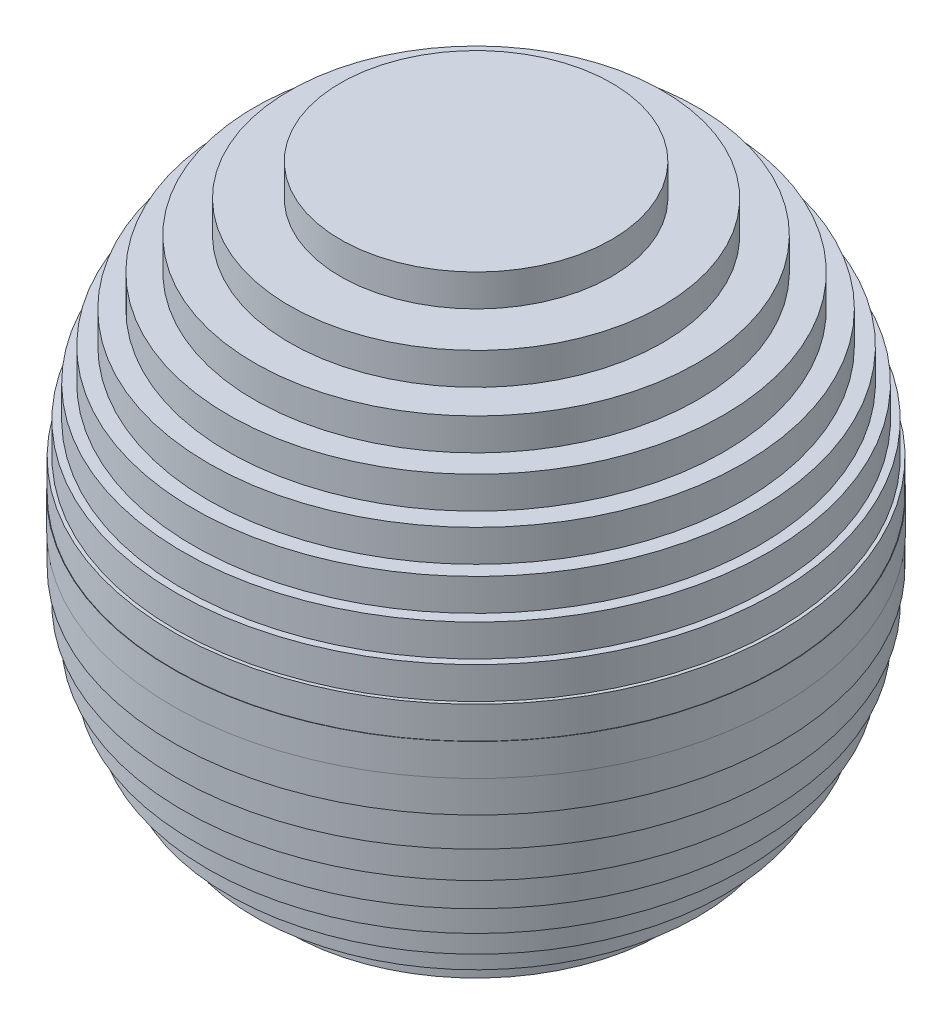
from build123d import *


with BuildPart() as part:
    # Sketch4 → Revolve4 (revolve)
    with BuildSketch(Plane.XY):
        Polygon((47.5, 2.5), (47.5, -2.5), (47.434164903, -2.5), (47.434164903, -7.5), (46.904157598, -7.5), (46.904157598, -12.5), (45.82575695, -12.5), (45.82575695, -17.5), (44.158804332, -17.5), (44.158804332, -22.5), (41.833001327, -22.5), (41.833001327, -27.5), (38.729833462, -27.5), (38.729833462, -32.5), (34.641016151, -32.5), (34.641016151, -37.5), (29.154759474, -37.5), (29.154759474, -42.5), (21.213203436, -42.5), (21.213203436, -47.5), (0, -47.5), (0, 47.5), (21.213203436, 47.5), (21.213203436, 42.5), (29.154759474, 42.5), (29.154759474, 37.5), (34.641016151, 37.5), (34.641016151, 32.5), (38.729833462, 32.5), (38.729833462, 27.5), (41.833001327, 27.5), (41.833001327, 22.5), (44.158804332, 22.5), (44.158804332, 17.5), (45.82575695, 17.5), (45.82575695, 12.5), (46.904157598, 12.5), (46.904157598, 7.5), (47.434164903, 7.5), (47.434164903, 2.5), align=None)
    revolve(axis=Axis((0, -47.5, 0), (0, 1, 0)))


solid = part.part
